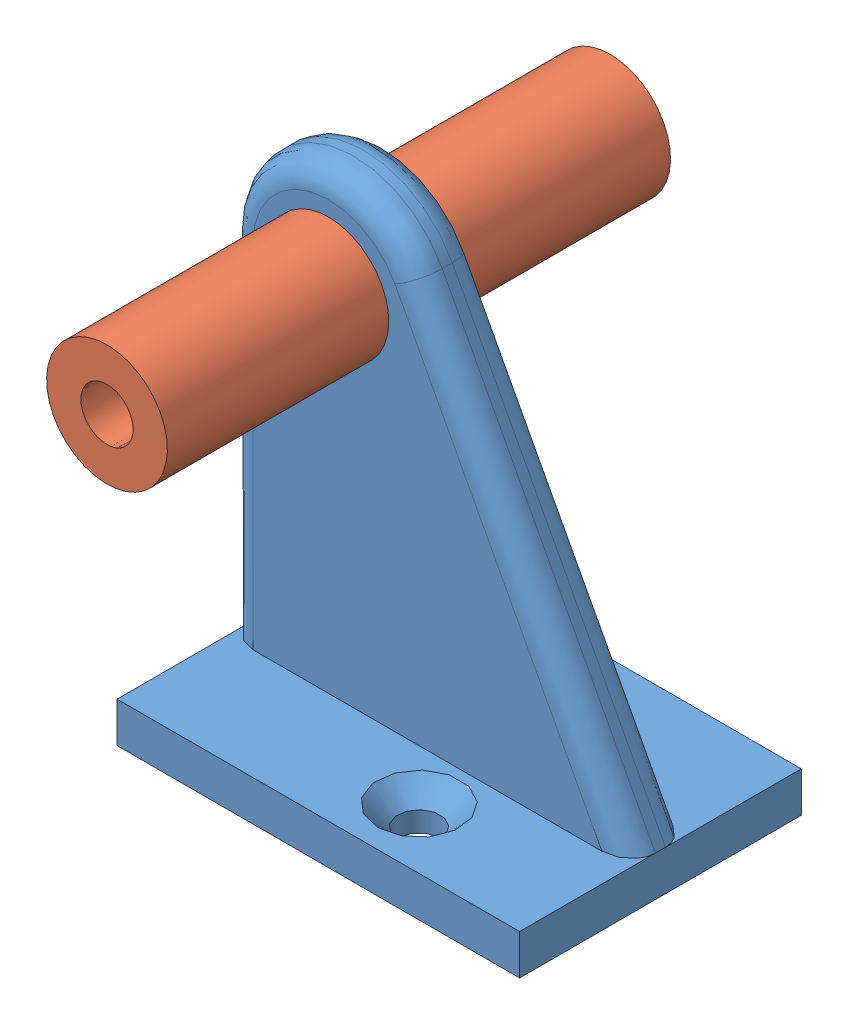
SolidWorks assembly 4670021341_Support_Galet.sldasm, configuration Défaut (file format 13000). Lengths in mm.
Overall size (40 49 50).
2 component instances, 2 part files, 0 mates.
Components (placement in the parent):
- 4670021341_1-1: 4670021341_1.SLDPRT [Défaut] at origin size (40 49 28)
- 4670021341_2-1: 4670021341_2.SLDPRT [Défaut] at (-10 35 0) x (0.376117 0.926572 0) z (0 0 1) size (12 12 50)
